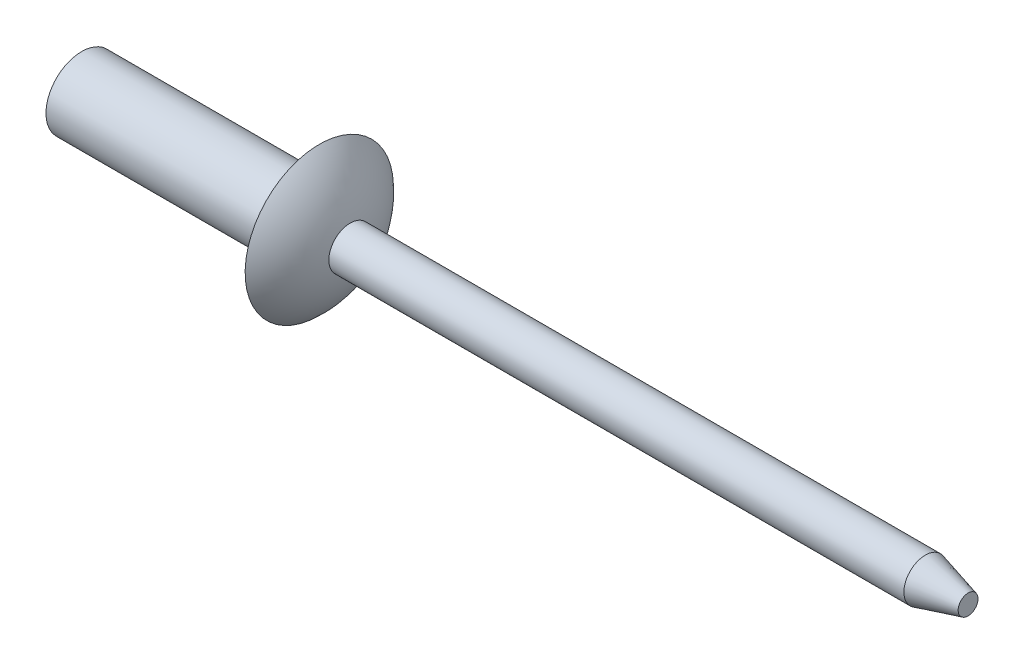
from build123d import *

# Parameters (mm, degrees)
FILLET1_R      = 0.5
CHAMFER1_SIZE  = 1.8
CHAMFER1_SIZE2 = 0.482308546


with BuildPart() as part:
    # Sketch1 → Base-Revolve (revolve)
    with BuildSketch(Plane(origin=(-11.603452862, 14.723452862, 0), x_dir=(0, -1, 0), z_dir=(0, 0, 1)), mode=Mode.PRIVATE) as base_revolve_sk:
        with BuildLine():
            Line((14.723452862, 11.603452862), (16.223452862, 11.603452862))
            Line((16.223452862, 11.603452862), (16.223452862, 21.603452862))
            Line((16.223452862, 21.603452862), (17.843452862, 21.603452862))
            ThreePointArc((17.843452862, 21.603452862), (16.836228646, 22.429648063), (15.623452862, 22.905330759))
            Line((15.623452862, 22.905330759), (15.623452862, 48.905330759))
            Line((15.623452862, 48.905330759), (14.723452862, 48.905330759))
            Line((14.723452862, 48.905330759), (14.723452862, 11.603452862))
        make_face()
    revolve(base_revolve_sk.sketch.rotate(Axis((22.734231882, 0, 0), (-1, 0, 0)), 180), axis=Axis((22.734231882, 0, 0), (-1, 0, 0)))

    # Fillet1
    fillet1_edges = [part.edges().sort_by_distance(p)[0] for p in [
        (10, -1.5, 0),
    ]]
    fillet(fillet1_edges, radius=FILLET1_R)

    # Chamfer1
    chamfer1_edges = [part.edges().sort_by_distance(p)[0] for p in [
        (37.301877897, -0.9, 0),
    ]]
    chamfer1_side = [part.faces().sort_by_distance(p)[0] for p in [
        (24.301877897, -0.9, 0),
    ]]
    chamfer(chamfer1_edges, length=CHAMFER1_SIZE, length2=CHAMFER1_SIZE2, reference=chamfer1_side[0])


solid = part.part
